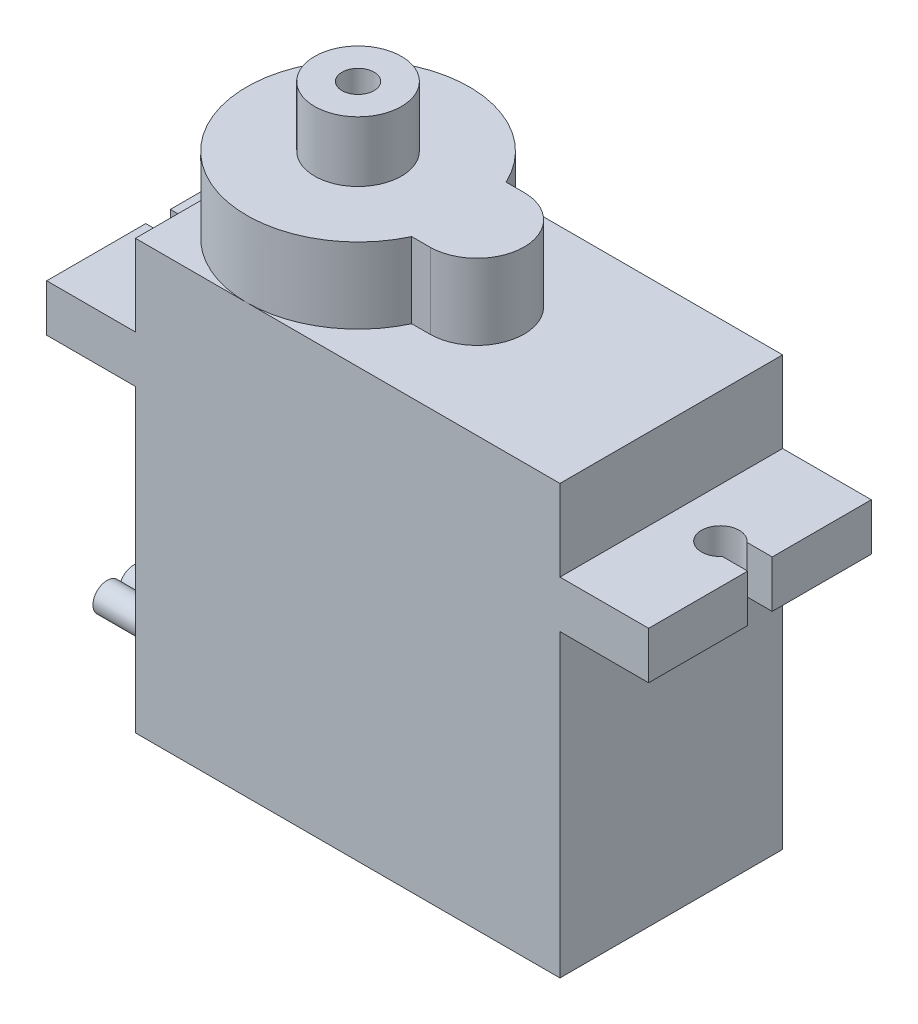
ISO-10303-21;
HEADER;
FILE_DESCRIPTION(('STEP AP214'),'2;1');
FILE_NAME('part.step','',(''),(''),'','','');
FILE_SCHEMA(('AUTOMOTIVE_DESIGN { 1 0 10303 214 1 1 1 1 }'));
ENDSEC;
DATA;
#1=APPLICATION_CONTEXT('core data for automotive mechanical design processes');
#2=APPLICATION_PROTOCOL_DEFINITION('international standard','automotive_design',2000,#1);
#3=PRODUCT_CONTEXT('',#1,'mechanical');
#4=PRODUCT('Part','Part','',(#3));
#5=PRODUCT_RELATED_PRODUCT_CATEGORY('part','',(#4));
#6=PRODUCT_DEFINITION_FORMATION('','',#4);
#7=PRODUCT_DEFINITION_CONTEXT('part definition',#1,'design');
#8=PRODUCT_DEFINITION('design','',#6,#7);
#9=PRODUCT_DEFINITION_SHAPE('','',#8);
#10=(LENGTH_UNIT() NAMED_UNIT(*) SI_UNIT(.MILLI.,.METRE.));
#11=(NAMED_UNIT(*) PLANE_ANGLE_UNIT() SI_UNIT($,.RADIAN.));
#12=(NAMED_UNIT(*) SI_UNIT($,.STERADIAN.) SOLID_ANGLE_UNIT());
#13=UNCERTAINTY_MEASURE_WITH_UNIT(LENGTH_MEASURE(1.E-05),#10,'distance_accuracy_value','');
#14=(GEOMETRIC_REPRESENTATION_CONTEXT(3) GLOBAL_UNCERTAINTY_ASSIGNED_CONTEXT((#13)) GLOBAL_UNIT_ASSIGNED_CONTEXT((#10,
#11,#12)) REPRESENTATION_CONTEXT('',''));
#15=CARTESIAN_POINT('',(0.,0.,0.));
#16=DIRECTION('',(0.,0.,1.));
#17=DIRECTION('',(1.,0.,0.));
#18=AXIS2_PLACEMENT_3D('',#15,#16,#17);
#19=CARTESIAN_POINT('',(27.2,18.4,5.9));
#20=DIRECTION('',(-1.,0.,0.));
#21=DIRECTION('',(0.,0.,1.));
#22=AXIS2_PLACEMENT_3D('',#19,#20,#21);
#23=PLANE('',#22);
#24=DIRECTION('',(0.,0.,-1.));
#25=VECTOR('',#24,1.);
#26=CARTESIAN_POINT('',(27.2,18.4,5.9));
#27=LINE('',#26,#25);
#28=CARTESIAN_POINT('',(27.2,18.4,-0.65));
#29=VERTEX_POINT('',#28);
#30=CARTESIAN_POINT('',(27.2,18.4,-5.9));
#31=VERTEX_POINT('',#30);
#32=EDGE_CURVE('E432',#29,#31,#27,.T.);
#33=ORIENTED_EDGE('',*,*,#32,.F.);
#34=DIRECTION('',(0.,-1.,0.));
#35=VECTOR('',#34,1.);
#36=CARTESIAN_POINT('',(27.2,18.4,-0.65));
#37=LINE('',#36,#35);
#38=CARTESIAN_POINT('',(27.2,15.9,-0.65));
#39=VERTEX_POINT('',#38);
#40=EDGE_CURVE('E294',#29,#39,#37,.T.);
#41=ORIENTED_EDGE('',*,*,#40,.T.);
#42=DIRECTION('',(0.,0.,-1.));
#43=VECTOR('',#42,1.);
#44=CARTESIAN_POINT('',(27.2,15.9,5.9));
#45=LINE('',#44,#43);
#46=CARTESIAN_POINT('',(27.2,15.9,-5.9));
#47=VERTEX_POINT('',#46);
#48=EDGE_CURVE('E436',#39,#47,#45,.T.);
#49=ORIENTED_EDGE('',*,*,#48,.T.);
#50=DIRECTION('',(0.,1.,0.));
#51=VECTOR('',#50,1.);
#52=CARTESIAN_POINT('',(27.2,18.4,-5.9));
#53=LINE('',#52,#51);
#54=EDGE_CURVE('E384',#47,#31,#53,.T.);
#55=ORIENTED_EDGE('',*,*,#54,.T.);
#56=EDGE_LOOP('',(#33,#41,#49,#55));
#57=FACE_BOUND('',#56,.T.);
#58=ADVANCED_FACE('F41',(#57),#23,.F.);
#59=CARTESIAN_POINT('',(-4.7,15.9,5.9));
#60=DIRECTION('',(1.,0.,0.));
#61=DIRECTION('',(0.,0.,-1.));
#62=AXIS2_PLACEMENT_3D('',#59,#60,#61);
#63=PLANE('',#62);
#64=DIRECTION('',(0.,0.,-1.));
#65=VECTOR('',#64,1.);
#66=CARTESIAN_POINT('',(-4.7,15.9,5.9));
#67=LINE('',#66,#65);
#68=CARTESIAN_POINT('',(-4.7,15.9,-0.65));
#69=VERTEX_POINT('',#68);
#70=CARTESIAN_POINT('',(-4.7,15.9,-5.9));
#71=VERTEX_POINT('',#70);
#72=EDGE_CURVE('E411',#69,#71,#67,.T.);
#73=ORIENTED_EDGE('',*,*,#72,.F.);
#74=DIRECTION('',(0.,1.,0.));
#75=VECTOR('',#74,1.);
#76=CARTESIAN_POINT('',(-4.7,15.9,-0.65));
#77=LINE('',#76,#75);
#78=CARTESIAN_POINT('',(-4.7,18.4,-0.65));
#79=VERTEX_POINT('',#78);
#80=EDGE_CURVE('E285',#69,#79,#77,.T.);
#81=ORIENTED_EDGE('',*,*,#80,.T.);
#82=DIRECTION('',(0.,0.,-1.));
#83=VECTOR('',#82,1.);
#84=CARTESIAN_POINT('',(-4.7,18.4,5.9));
#85=LINE('',#84,#83);
#86=CARTESIAN_POINT('',(-4.7,18.4,-5.9));
#87=VERTEX_POINT('',#86);
#88=EDGE_CURVE('E415',#79,#87,#85,.T.);
#89=ORIENTED_EDGE('',*,*,#88,.T.);
#90=DIRECTION('',(0.,-1.,0.));
#91=VECTOR('',#90,1.);
#92=CARTESIAN_POINT('',(-4.7,15.9,-5.9));
#93=LINE('',#92,#91);
#94=EDGE_CURVE('E400',#87,#71,#93,.T.);
#95=ORIENTED_EDGE('',*,*,#94,.T.);
#96=EDGE_LOOP('',(#73,#81,#89,#95));
#97=FACE_BOUND('',#96,.T.);
#98=ADVANCED_FACE('F462',(#97),#63,.F.);
#99=CARTESIAN_POINT('',(0.,22.7,5.9));
#100=DIRECTION('',(0.,-1.,0.));
#101=DIRECTION('',(1.,0.,0.));
#102=AXIS2_PLACEMENT_3D('',#99,#100,#101);
#103=PLANE('',#102);
#104=CARTESIAN_POINT('',(5.9,22.7,0.));
#105=DIRECTION('',(0.,1.,0.));
#106=DIRECTION('',(-1.,0.,0.));
#107=AXIS2_PLACEMENT_3D('',#104,#105,#106);
#108=CIRCLE('',#107,5.9);
#109=CARTESIAN_POINT('',(0.,22.7,0.));
#110=VERTEX_POINT('',#109);
#111=CARTESIAN_POINT('',(5.9,22.7,5.9));
#112=VERTEX_POINT('',#111);
#113=EDGE_CURVE('E332',#110,#112,#108,.T.);
#114=ORIENTED_EDGE('',*,*,#113,.F.);
#115=DIRECTION('',(0.,0.,-1.));
#116=VECTOR('',#115,1.);
#117=CARTESIAN_POINT('',(0.,22.7,5.9));
#118=LINE('',#117,#116);
#119=CARTESIAN_POINT('',(0.,22.7,5.9));
#120=VERTEX_POINT('',#119);
#121=EDGE_CURVE('E423',#120,#110,#118,.T.);
#122=ORIENTED_EDGE('',*,*,#121,.F.);
#123=DIRECTION('',(-1.,0.,0.));
#124=VECTOR('',#123,1.);
#125=CARTESIAN_POINT('',(0.,22.7,5.9));
#126=LINE('',#125,#124);
#127=EDGE_CURVE('E362',#112,#120,#126,.T.);
#128=ORIENTED_EDGE('',*,*,#127,.F.);
#129=EDGE_LOOP('',(#114,#122,#128));
#130=FACE_BOUND('',#129,.T.);
#131=ADVANCED_FACE('F518',(#130),#103,.F.);
#132=CARTESIAN_POINT('',(11.244155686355,22.7,2.5));
#133=VERTEX_POINT('',#132);
#134=EDGE_CURVE('E812',#112,#133,#108,.T.);
#135=ORIENTED_EDGE('',*,*,#134,.F.);
#136=CARTESIAN_POINT('',(22.5,22.7,5.9));
#137=VERTEX_POINT('',#136);
#138=EDGE_CURVE('E363',#137,#112,#126,.T.);
#139=ORIENTED_EDGE('',*,*,#138,.F.);
#140=DIRECTION('',(0.,0.,-1.));
#141=VECTOR('',#140,1.);
#142=CARTESIAN_POINT('',(22.5,22.7,5.9));
#143=LINE('',#142,#141);
#144=CARTESIAN_POINT('',(22.5,22.7,-5.9));
#145=VERTEX_POINT('',#144);
#146=EDGE_CURVE('E426',#137,#145,#143,.T.);
#147=ORIENTED_EDGE('',*,*,#146,.T.);
#148=DIRECTION('',(-1.,0.,0.));
#149=VECTOR('',#148,1.);
#150=CARTESIAN_POINT('',(0.,22.7,-5.9));
#151=LINE('',#150,#149);
#152=CARTESIAN_POINT('',(5.9,22.7,-5.9));
#153=VERTEX_POINT('',#152);
#154=EDGE_CURVE('E392',#145,#153,#151,.T.);
#155=ORIENTED_EDGE('',*,*,#154,.T.);
#156=CARTESIAN_POINT('',(11.244155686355,22.7,-2.5));
#157=VERTEX_POINT('',#156);
#158=EDGE_CURVE('E329',#157,#153,#108,.T.);
#159=ORIENTED_EDGE('',*,*,#158,.F.);
#160=DIRECTION('',(-1.,0.,0.));
#161=VECTOR('',#160,1.);
#162=CARTESIAN_POINT('',(11.244155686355,22.7,-2.5));
#163=LINE('',#162,#161);
#164=CARTESIAN_POINT('',(12.1689615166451,22.7,-2.5));
#165=VERTEX_POINT('',#164);
#166=EDGE_CURVE('E326',#165,#157,#163,.T.);
#167=ORIENTED_EDGE('',*,*,#166,.F.);
#168=CARTESIAN_POINT('',(12.2,22.7,0.));
#169=DIRECTION('',(0.,1.,0.));
#170=DIRECTION('',(-1.,0.,0.));
#171=AXIS2_PLACEMENT_3D('',#168,#169,#170);
#172=CIRCLE('',#171,2.50019267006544);
#173=CARTESIAN_POINT('',(12.2310384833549,22.7,2.5));
#174=VERTEX_POINT('',#173);
#175=EDGE_CURVE('E310',#174,#165,#172,.T.);
#176=ORIENTED_EDGE('',*,*,#175,.F.);
#177=DIRECTION('',(1.,0.,0.));
#178=VECTOR('',#177,1.);
#179=CARTESIAN_POINT('',(11.244155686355,22.7,2.5));
#180=LINE('',#179,#178);
#181=EDGE_CURVE('E317',#133,#174,#180,.T.);
#182=ORIENTED_EDGE('',*,*,#181,.F.);
#183=EDGE_LOOP('',(#135,#139,#147,#155,#159,#167,#176,#182));
#184=FACE_BOUND('',#183,.T.);
#185=ADVANCED_FACE('F668',(#184),#103,.F.);
#186=EDGE_CURVE('E333',#153,#110,#108,.T.);
#187=ORIENTED_EDGE('',*,*,#186,.F.);
#188=CARTESIAN_POINT('',(0.,22.7,-5.9));
#189=VERTEX_POINT('',#188);
#190=EDGE_CURVE('E391',#153,#189,#151,.T.);
#191=ORIENTED_EDGE('',*,*,#190,.T.);
#192=EDGE_CURVE('E422',#110,#189,#118,.T.);
#193=ORIENTED_EDGE('',*,*,#192,.F.);
#194=EDGE_LOOP('',(#187,#191,#193));
#195=FACE_BOUND('',#194,.T.);
#196=ADVANCED_FACE('F664',(#195),#103,.F.);
#197=CARTESIAN_POINT('',(22.5,0.,5.9));
#198=DIRECTION('',(0.,1.,0.));
#199=DIRECTION('',(-1.,0.,0.));
#200=AXIS2_PLACEMENT_3D('',#197,#198,#199);
#201=PLANE('',#200);
#202=DIRECTION('',(1.,0.,0.));
#203=VECTOR('',#202,1.);
#204=CARTESIAN_POINT('',(22.5,0.,-5.9));
#205=LINE('',#204,#203);
#206=CARTESIAN_POINT('',(0.,0.,-5.9));
#207=VERTEX_POINT('',#206);
#208=CARTESIAN_POINT('',(22.5,0.,-5.9));
#209=VERTEX_POINT('',#208);
#210=EDGE_CURVE('E347',#207,#209,#205,.T.);
#211=ORIENTED_EDGE('',*,*,#210,.T.);
#212=DIRECTION('',(0.,0.,-1.));
#213=VECTOR('',#212,1.);
#214=CARTESIAN_POINT('',(22.5,0.,5.9));
#215=LINE('',#214,#213);
#216=CARTESIAN_POINT('',(22.5,0.,5.9));
#217=VERTEX_POINT('',#216);
#218=EDGE_CURVE('E443',#217,#209,#215,.T.);
#219=ORIENTED_EDGE('',*,*,#218,.F.);
#220=DIRECTION('',(1.,0.,0.));
#221=VECTOR('',#220,1.);
#222=CARTESIAN_POINT('',(22.5,0.,5.9));
#223=LINE('',#222,#221);
#224=CARTESIAN_POINT('',(0.,0.,5.9));
#225=VERTEX_POINT('',#224);
#226=EDGE_CURVE('E348',#225,#217,#223,.T.);
#227=ORIENTED_EDGE('',*,*,#226,.F.);
#228=DIRECTION('',(0.,0.,-1.));
#229=VECTOR('',#228,1.);
#230=CARTESIAN_POINT('',(0.,0.,5.9));
#231=LINE('',#230,#229);
#232=EDGE_CURVE('E376',#225,#207,#231,.T.);
#233=ORIENTED_EDGE('',*,*,#232,.T.);
#234=EDGE_LOOP('',(#211,#219,#227,#233));
#235=FACE_BOUND('',#234,.T.);
#236=ADVANCED_FACE('F43',(#235),#201,.F.);
#237=CARTESIAN_POINT('',(22.5,15.9,5.9));
#238=DIRECTION('',(-1.,0.,0.));
#239=DIRECTION('',(0.,-1.,0.));
#240=AXIS2_PLACEMENT_3D('',#237,#238,#239);
#241=PLANE('',#240);
#242=DIRECTION('',(0.,1.,0.));
#243=VECTOR('',#242,1.);
#244=CARTESIAN_POINT('',(22.5,15.9,-5.9));
#245=LINE('',#244,#243);
#246=CARTESIAN_POINT('',(22.5,15.9,-5.9));
#247=VERTEX_POINT('',#246);
#248=EDGE_CURVE('E379',#209,#247,#245,.T.);
#249=ORIENTED_EDGE('',*,*,#248,.T.);
#250=DIRECTION('',(0.,0.,-1.));
#251=VECTOR('',#250,1.);
#252=CARTESIAN_POINT('',(22.5,15.9,5.9));
#253=LINE('',#252,#251);
#254=CARTESIAN_POINT('',(22.5,15.9,5.9));
#255=VERTEX_POINT('',#254);
#256=EDGE_CURVE('E440',#255,#247,#253,.T.);
#257=ORIENTED_EDGE('',*,*,#256,.F.);
#258=DIRECTION('',(0.,1.,0.));
#259=VECTOR('',#258,1.);
#260=CARTESIAN_POINT('',(22.5,15.9,5.9));
#261=LINE('',#260,#259);
#262=EDGE_CURVE('E351',#217,#255,#261,.T.);
#263=ORIENTED_EDGE('',*,*,#262,.F.);
#264=ORIENTED_EDGE('',*,*,#218,.T.);
#265=EDGE_LOOP('',(#249,#257,#263,#264));
#266=FACE_BOUND('',#265,.T.);
#267=ADVANCED_FACE('F533',(#266),#241,.F.);
#268=CARTESIAN_POINT('',(27.2,15.9,5.9));
#269=DIRECTION('',(0.,1.,0.));
#270=DIRECTION('',(0.,0.,1.));
#271=AXIS2_PLACEMENT_3D('',#268,#269,#270);
#272=PLANE('',#271);
#273=ORIENTED_EDGE('',*,*,#48,.F.);
#274=DIRECTION('',(-1.,0.,0.));
#275=VECTOR('',#274,1.);
#276=CARTESIAN_POINT('',(27.2,15.9,-0.65));
#277=LINE('',#276,#275);
#278=CARTESIAN_POINT('',(25.8599342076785,15.9,-0.65));
#279=VERTEX_POINT('',#278);
#280=EDGE_CURVE('E297',#39,#279,#277,.T.);
#281=ORIENTED_EDGE('',*,*,#280,.T.);
#282=CARTESIAN_POINT('',(25.1,15.9,0.));
#283=DIRECTION('',(0.,1.,0.));
#284=DIRECTION('',(0.,0.,1.));
#285=AXIS2_PLACEMENT_3D('',#282,#283,#284);
#286=CIRCLE('',#285,1.);
#287=CARTESIAN_POINT('',(25.8599342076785,15.9,0.649999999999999));
#288=VERTEX_POINT('',#287);
#289=EDGE_CURVE('E300',#279,#288,#286,.T.);
#290=ORIENTED_EDGE('',*,*,#289,.T.);
#291=DIRECTION('',(1.,0.,0.));
#292=VECTOR('',#291,1.);
#293=CARTESIAN_POINT('',(27.2,15.9,0.65));
#294=LINE('',#293,#292);
#295=CARTESIAN_POINT('',(27.2,15.9,0.65));
#296=VERTEX_POINT('',#295);
#297=EDGE_CURVE('E291',#288,#296,#294,.T.);
#298=ORIENTED_EDGE('',*,*,#297,.T.);
#299=CARTESIAN_POINT('',(27.2,15.9,5.9));
#300=VERTEX_POINT('',#299);
#301=EDGE_CURVE('E437',#300,#296,#45,.T.);
#302=ORIENTED_EDGE('',*,*,#301,.F.);
#303=DIRECTION('',(1.,0.,0.));
#304=VECTOR('',#303,1.);
#305=CARTESIAN_POINT('',(27.2,15.9,5.9));
#306=LINE('',#305,#304);
#307=EDGE_CURVE('E354',#255,#300,#306,.T.);
#308=ORIENTED_EDGE('',*,*,#307,.F.);
#309=ORIENTED_EDGE('',*,*,#256,.T.);
#310=DIRECTION('',(1.,0.,0.));
#311=VECTOR('',#310,1.);
#312=CARTESIAN_POINT('',(27.2,15.9,-5.9));
#313=LINE('',#312,#311);
#314=EDGE_CURVE('E381',#247,#47,#313,.T.);
#315=ORIENTED_EDGE('',*,*,#314,.T.);
#316=EDGE_LOOP('',(#273,#281,#290,#298,#302,#308,#309,#315));
#317=FACE_BOUND('',#316,.T.);
#318=ADVANCED_FACE('F525',(#317),#272,.F.);
#319=ORIENTED_EDGE('',*,*,#301,.T.);
#320=DIRECTION('',(0.,1.,0.));
#321=VECTOR('',#320,1.);
#322=CARTESIAN_POINT('',(27.2,18.4,0.65));
#323=LINE('',#322,#321);
#324=CARTESIAN_POINT('',(27.2,18.4,0.649999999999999));
#325=VERTEX_POINT('',#324);
#326=EDGE_CURVE('E288',#296,#325,#323,.T.);
#327=ORIENTED_EDGE('',*,*,#326,.T.);
#328=CARTESIAN_POINT('',(27.2,18.4,5.9));
#329=VERTEX_POINT('',#328);
#330=EDGE_CURVE('E433',#329,#325,#27,.T.);
#331=ORIENTED_EDGE('',*,*,#330,.F.);
#332=DIRECTION('',(0.,1.,0.));
#333=VECTOR('',#332,1.);
#334=CARTESIAN_POINT('',(27.2,18.4,5.9));
#335=LINE('',#334,#333);
#336=EDGE_CURVE('E356',#300,#329,#335,.T.);
#337=ORIENTED_EDGE('',*,*,#336,.F.);
#338=EDGE_LOOP('',(#319,#327,#331,#337));
#339=FACE_BOUND('',#338,.T.);
#340=ADVANCED_FACE('F514',(#339),#23,.F.);
#341=CARTESIAN_POINT('',(22.5,18.4,5.9));
#342=DIRECTION('',(0.,-1.,0.));
#343=DIRECTION('',(0.,0.,-1.));
#344=AXIS2_PLACEMENT_3D('',#341,#342,#343);
#345=PLANE('',#344);
#346=CARTESIAN_POINT('',(25.1,18.4,0.));
#347=DIRECTION('',(0.,1.,0.));
#348=DIRECTION('',(0.,0.,1.));
#349=AXIS2_PLACEMENT_3D('',#346,#347,#348);
#350=CIRCLE('',#349,1.);
#351=CARTESIAN_POINT('',(25.8599342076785,18.4,-0.65));
#352=VERTEX_POINT('',#351);
#353=CARTESIAN_POINT('',(25.8599342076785,18.4,0.65));
#354=VERTEX_POINT('',#353);
#355=EDGE_CURVE('E265',#352,#354,#350,.T.);
#356=ORIENTED_EDGE('',*,*,#355,.F.);
#357=DIRECTION('',(1.,0.,0.));
#358=VECTOR('',#357,1.);
#359=CARTESIAN_POINT('',(22.5,18.4,-0.65));
#360=LINE('',#359,#358);
#361=EDGE_CURVE('E11',#352,#29,#360,.T.);
#362=ORIENTED_EDGE('',*,*,#361,.T.);
#363=ORIENTED_EDGE('',*,*,#32,.T.);
#364=DIRECTION('',(-1.,0.,0.));
#365=VECTOR('',#364,1.);
#366=CARTESIAN_POINT('',(22.5,18.4,-5.9));
#367=LINE('',#366,#365);
#368=CARTESIAN_POINT('',(22.5,18.4,-5.9));
#369=VERTEX_POINT('',#368);
#370=EDGE_CURVE('E387',#31,#369,#367,.T.);
#371=ORIENTED_EDGE('',*,*,#370,.T.);
#372=DIRECTION('',(0.,0.,-1.));
#373=VECTOR('',#372,1.);
#374=CARTESIAN_POINT('',(22.5,18.4,5.9));
#375=LINE('',#374,#373);
#376=CARTESIAN_POINT('',(22.5,18.4,5.9));
#377=VERTEX_POINT('',#376);
#378=EDGE_CURVE('E429',#377,#369,#375,.T.);
#379=ORIENTED_EDGE('',*,*,#378,.F.);
#380=DIRECTION('',(-1.,0.,0.));
#381=VECTOR('',#380,1.);
#382=CARTESIAN_POINT('',(22.5,18.4,5.9));
#383=LINE('',#382,#381);
#384=EDGE_CURVE('E358',#329,#377,#383,.T.);
#385=ORIENTED_EDGE('',*,*,#384,.F.);
#386=ORIENTED_EDGE('',*,*,#330,.T.);
#387=DIRECTION('',(1.,0.,0.));
#388=VECTOR('',#387,1.);
#389=CARTESIAN_POINT('',(25.8599342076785,18.4,0.649999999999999));
#390=LINE('',#389,#388);
#391=EDGE_CURVE('E267',#354,#325,#390,.T.);
#392=ORIENTED_EDGE('',*,*,#391,.F.);
#393=EDGE_LOOP('',(#356,#362,#363,#371,#379,#385,#386,#392));
#394=FACE_BOUND('',#393,.T.);
#395=ADVANCED_FACE('F524',(#394),#345,.F.);
#396=CARTESIAN_POINT('',(22.5,22.7,5.9));
#397=DIRECTION('',(-1.,0.,0.));
#398=DIRECTION('',(0.,0.,1.));
#399=AXIS2_PLACEMENT_3D('',#396,#397,#398);
#400=PLANE('',#399);
#401=DIRECTION('',(0.,1.,0.));
#402=VECTOR('',#401,1.);
#403=CARTESIAN_POINT('',(22.5,22.7,-5.9));
#404=LINE('',#403,#402);
#405=EDGE_CURVE('E389',#369,#145,#404,.T.);
#406=ORIENTED_EDGE('',*,*,#405,.T.);
#407=ORIENTED_EDGE('',*,*,#146,.F.);
#408=DIRECTION('',(0.,1.,0.));
#409=VECTOR('',#408,1.);
#410=CARTESIAN_POINT('',(22.5,22.7,5.9));
#411=LINE('',#410,#409);
#412=EDGE_CURVE('E360',#377,#137,#411,.T.);
#413=ORIENTED_EDGE('',*,*,#412,.F.);
#414=ORIENTED_EDGE('',*,*,#378,.T.);
#415=EDGE_LOOP('',(#406,#407,#413,#414));
#416=FACE_BOUND('',#415,.T.);
#417=ADVANCED_FACE('F531',(#416),#400,.F.);
#418=CARTESIAN_POINT('',(0.,18.4,5.9));
#419=DIRECTION('',(1.,0.,0.));
#420=DIRECTION('',(0.,0.,-1.));
#421=AXIS2_PLACEMENT_3D('',#418,#419,#420);
#422=PLANE('',#421);
#423=DIRECTION('',(0.,-1.,0.));
#424=VECTOR('',#423,1.);
#425=CARTESIAN_POINT('',(0.,18.4,-5.9));
#426=LINE('',#425,#424);
#427=CARTESIAN_POINT('',(0.,18.4,-5.9));
#428=VERTEX_POINT('',#427);
#429=EDGE_CURVE('E395',#189,#428,#426,.T.);
#430=ORIENTED_EDGE('',*,*,#429,.T.);
#431=DIRECTION('',(0.,0.,-1.));
#432=VECTOR('',#431,1.);
#433=CARTESIAN_POINT('',(0.,18.4,5.9));
#434=LINE('',#433,#432);
#435=CARTESIAN_POINT('',(0.,18.4,5.9));
#436=VERTEX_POINT('',#435);
#437=EDGE_CURVE('E419',#436,#428,#434,.T.);
#438=ORIENTED_EDGE('',*,*,#437,.F.);
#439=DIRECTION('',(0.,-1.,0.));
#440=VECTOR('',#439,1.);
#441=CARTESIAN_POINT('',(0.,18.4,5.9));
#442=LINE('',#441,#440);
#443=EDGE_CURVE('E366',#120,#436,#442,.T.);
#444=ORIENTED_EDGE('',*,*,#443,.F.);
#445=ORIENTED_EDGE('',*,*,#121,.T.);
#446=ORIENTED_EDGE('',*,*,#192,.T.);
#447=EDGE_LOOP('',(#430,#438,#444,#445,#446));
#448=FACE_BOUND('',#447,.T.);
#449=ADVANCED_FACE('F795',(#448),#422,.F.);
#450=CARTESIAN_POINT('',(-4.7,18.4,5.9));
#451=DIRECTION('',(0.,-1.,0.));
#452=DIRECTION('',(0.,0.,-1.));
#453=AXIS2_PLACEMENT_3D('',#450,#451,#452);
#454=PLANE('',#453);
#455=ORIENTED_EDGE('',*,*,#88,.F.);
#456=DIRECTION('',(-1.,0.,0.));
#457=VECTOR('',#456,1.);
#458=CARTESIAN_POINT('',(-6.63542789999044,18.4,-0.65));
#459=LINE('',#458,#457);
#460=CARTESIAN_POINT('',(-3.35993420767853,18.4,-0.65));
#461=VERTEX_POINT('',#460);
#462=EDGE_CURVE('E278',#461,#79,#459,.T.);
#463=ORIENTED_EDGE('',*,*,#462,.F.);
#464=CARTESIAN_POINT('',(-2.6,18.4,0.));
#465=DIRECTION('',(0.,1.,0.));
#466=DIRECTION('',(0.,0.,1.));
#467=AXIS2_PLACEMENT_3D('',#464,#465,#466);
#468=CIRCLE('',#467,1.);
#469=CARTESIAN_POINT('',(-3.35993420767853,18.4,0.65));
#470=VERTEX_POINT('',#469);
#471=EDGE_CURVE('E259',#470,#461,#468,.T.);
#472=ORIENTED_EDGE('',*,*,#471,.F.);
#473=DIRECTION('',(1.,0.,0.));
#474=VECTOR('',#473,1.);
#475=CARTESIAN_POINT('',(-6.63542789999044,18.4,0.65));
#476=LINE('',#475,#474);
#477=CARTESIAN_POINT('',(-4.7,18.4,0.65));
#478=VERTEX_POINT('',#477);
#479=EDGE_CURVE('E256',#478,#470,#476,.T.);
#480=ORIENTED_EDGE('',*,*,#479,.F.);
#481=CARTESIAN_POINT('',(-4.7,18.4,5.9));
#482=VERTEX_POINT('',#481);
#483=EDGE_CURVE('E416',#482,#478,#85,.T.);
#484=ORIENTED_EDGE('',*,*,#483,.F.);
#485=DIRECTION('',(-1.,0.,0.));
#486=VECTOR('',#485,1.);
#487=CARTESIAN_POINT('',(-4.7,18.4,5.9));
#488=LINE('',#487,#486);
#489=EDGE_CURVE('E368',#436,#482,#488,.T.);
#490=ORIENTED_EDGE('',*,*,#489,.F.);
#491=ORIENTED_EDGE('',*,*,#437,.T.);
#492=DIRECTION('',(-1.,0.,0.));
#493=VECTOR('',#492,1.);
#494=CARTESIAN_POINT('',(-4.7,18.4,-5.9));
#495=LINE('',#494,#493);
#496=EDGE_CURVE('E397',#428,#87,#495,.T.);
#497=ORIENTED_EDGE('',*,*,#496,.T.);
#498=EDGE_LOOP('',(#455,#463,#472,#480,#484,#490,#491,#497));
#499=FACE_BOUND('',#498,.T.);
#500=ADVANCED_FACE('F491',(#499),#454,.F.);
#501=ORIENTED_EDGE('',*,*,#483,.T.);
#502=DIRECTION('',(0.,-1.,0.));
#503=VECTOR('',#502,1.);
#504=CARTESIAN_POINT('',(-4.7,15.9,0.65));
#505=LINE('',#504,#503);
#506=CARTESIAN_POINT('',(-4.7,15.9,0.65));
#507=VERTEX_POINT('',#506);
#508=EDGE_CURVE('E273',#478,#507,#505,.T.);
#509=ORIENTED_EDGE('',*,*,#508,.T.);
#510=CARTESIAN_POINT('',(-4.7,15.9,5.9));
#511=VERTEX_POINT('',#510);
#512=EDGE_CURVE('E412',#511,#507,#67,.T.);
#513=ORIENTED_EDGE('',*,*,#512,.F.);
#514=DIRECTION('',(0.,-1.,0.));
#515=VECTOR('',#514,1.);
#516=CARTESIAN_POINT('',(-4.7,15.9,5.9));
#517=LINE('',#516,#515);
#518=EDGE_CURVE('E370',#482,#511,#517,.T.);
#519=ORIENTED_EDGE('',*,*,#518,.F.);
#520=EDGE_LOOP('',(#501,#509,#513,#519));
#521=FACE_BOUND('',#520,.T.);
#522=ADVANCED_FACE('F484',(#521),#63,.F.);
#523=CARTESIAN_POINT('',(0.,15.9,5.9));
#524=DIRECTION('',(0.,1.,0.));
#525=DIRECTION('',(0.,0.,1.));
#526=AXIS2_PLACEMENT_3D('',#523,#524,#525);
#527=PLANE('',#526);
#528=CARTESIAN_POINT('',(-2.6,15.9,0.));
#529=DIRECTION('',(0.,1.,0.));
#530=DIRECTION('',(0.,0.,1.));
#531=AXIS2_PLACEMENT_3D('',#528,#529,#530);
#532=CIRCLE('',#531,1.);
#533=CARTESIAN_POINT('',(-3.35993420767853,15.9,0.65));
#534=VERTEX_POINT('',#533);
#535=CARTESIAN_POINT('',(-3.35993420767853,15.9,-0.65));
#536=VERTEX_POINT('',#535);
#537=EDGE_CURVE('E452',#534,#536,#532,.T.);
#538=ORIENTED_EDGE('',*,*,#537,.T.);
#539=DIRECTION('',(-1.,0.,0.));
#540=VECTOR('',#539,1.);
#541=CARTESIAN_POINT('',(0.,15.9,-0.65));
#542=LINE('',#541,#540);
#543=EDGE_CURVE('E49',#536,#69,#542,.T.);
#544=ORIENTED_EDGE('',*,*,#543,.T.);
#545=ORIENTED_EDGE('',*,*,#72,.T.);
#546=DIRECTION('',(1.,0.,0.));
#547=VECTOR('',#546,1.);
#548=CARTESIAN_POINT('',(0.,15.9,-5.9));
#549=LINE('',#548,#547);
#550=CARTESIAN_POINT('',(0.,15.9,-5.9));
#551=VERTEX_POINT('',#550);
#552=EDGE_CURVE('E403',#71,#551,#549,.T.);
#553=ORIENTED_EDGE('',*,*,#552,.T.);
#554=DIRECTION('',(0.,0.,-1.));
#555=VECTOR('',#554,1.);
#556=CARTESIAN_POINT('',(0.,15.9,5.9));
#557=LINE('',#556,#555);
#558=CARTESIAN_POINT('',(0.,15.9,5.9));
#559=VERTEX_POINT('',#558);
#560=EDGE_CURVE('E408',#559,#551,#557,.T.);
#561=ORIENTED_EDGE('',*,*,#560,.F.);
#562=DIRECTION('',(1.,0.,0.));
#563=VECTOR('',#562,1.);
#564=CARTESIAN_POINT('',(0.,15.9,5.9));
#565=LINE('',#564,#563);
#566=EDGE_CURVE('E372',#511,#559,#565,.T.);
#567=ORIENTED_EDGE('',*,*,#566,.F.);
#568=ORIENTED_EDGE('',*,*,#512,.T.);
#569=DIRECTION('',(1.,0.,0.));
#570=VECTOR('',#569,1.);
#571=CARTESIAN_POINT('',(0.,15.9,0.65));
#572=LINE('',#571,#570);
#573=EDGE_CURVE('E449',#507,#534,#572,.T.);
#574=ORIENTED_EDGE('',*,*,#573,.T.);
#575=EDGE_LOOP('',(#538,#544,#545,#553,#561,#567,#568,#574));
#576=FACE_BOUND('',#575,.T.);
#577=ADVANCED_FACE('F457',(#576),#527,.F.);
#578=CARTESIAN_POINT('',(0.,0.,5.9));
#579=DIRECTION('',(1.,0.,0.));
#580=DIRECTION('',(0.,0.,-1.));
#581=AXIS2_PLACEMENT_3D('',#578,#579,#580);
#582=PLANE('',#581);
#583=CARTESIAN_POINT('',(0.,1.,1.4));
#584=DIRECTION('',(-1.,0.,0.));
#585=DIRECTION('',(0.,0.,1.));
#586=AXIS2_PLACEMENT_3D('',#583,#584,#585);
#587=CIRCLE('',#586,0.75);
#588=CARTESIAN_POINT('',(0.,0.730741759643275,0.7));
#589=VERTEX_POINT('',#588);
#590=CARTESIAN_POINT('',(0.,1.26925824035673,0.7));
#591=VERTEX_POINT('',#590);
#592=EDGE_CURVE('E255',#589,#591,#587,.T.);
#593=ORIENTED_EDGE('',*,*,#592,.F.);
#594=CARTESIAN_POINT('',(0.,1.,0.));
#595=DIRECTION('',(-1.,0.,0.));
#596=DIRECTION('',(0.,0.,1.));
#597=AXIS2_PLACEMENT_3D('',#594,#595,#596);
#598=CIRCLE('',#597,0.75);
#599=CARTESIAN_POINT('',(0.,0.730741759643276,-0.7));
#600=VERTEX_POINT('',#599);
#601=EDGE_CURVE('E252',#600,#589,#598,.T.);
#602=ORIENTED_EDGE('',*,*,#601,.F.);
#603=CARTESIAN_POINT('',(0.,1.,-1.4));
#604=DIRECTION('',(-1.,0.,0.));
#605=DIRECTION('',(0.,0.,1.));
#606=AXIS2_PLACEMENT_3D('',#603,#604,#605);
#607=CIRCLE('',#606,0.75);
#608=CARTESIAN_POINT('',(0.,1.26925824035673,-0.7));
#609=VERTEX_POINT('',#608);
#610=EDGE_CURVE('E61',#609,#600,#607,.T.);
#611=ORIENTED_EDGE('',*,*,#610,.F.);
#612=CARTESIAN_POINT('',(0.,1.,0.));
#613=DIRECTION('',(-1.,0.,0.));
#614=DIRECTION('',(0.,0.,1.));
#615=AXIS2_PLACEMENT_3D('',#612,#613,#614);
#616=CIRCLE('',#615,0.75);
#617=EDGE_CURVE('E56',#591,#609,#616,.T.);
#618=ORIENTED_EDGE('',*,*,#617,.F.);
#619=EDGE_LOOP('',(#593,#602,#611,#618));
#620=FACE_BOUND('',#619,.T.);
#621=DIRECTION('',(0.,-1.,0.));
#622=VECTOR('',#621,1.);
#623=CARTESIAN_POINT('',(0.,0.,-5.9));
#624=LINE('',#623,#622);
#625=EDGE_CURVE('E352',#551,#207,#624,.T.);
#626=ORIENTED_EDGE('',*,*,#625,.T.);
#627=ORIENTED_EDGE('',*,*,#232,.F.);
#628=DIRECTION('',(0.,-1.,0.));
#629=VECTOR('',#628,1.);
#630=CARTESIAN_POINT('',(0.,0.,5.9));
#631=LINE('',#630,#629);
#632=EDGE_CURVE('E374',#559,#225,#631,.T.);
#633=ORIENTED_EDGE('',*,*,#632,.F.);
#634=ORIENTED_EDGE('',*,*,#560,.T.);
#635=EDGE_LOOP('',(#626,#627,#633,#634));
#636=FACE_BOUND('',#635,.T.);
#637=ADVANCED_FACE('F475',(#620,#636),#582,.F.);
#638=CARTESIAN_POINT('',(0.,0.,5.9));
#639=DIRECTION('',(0.,0.,-1.));
#640=DIRECTION('',(-1.,0.,0.));
#641=AXIS2_PLACEMENT_3D('',#638,#639,#640);
#642=PLANE('',#641);
#643=ORIENTED_EDGE('',*,*,#226,.T.);
#644=ORIENTED_EDGE('',*,*,#262,.T.);
#645=ORIENTED_EDGE('',*,*,#307,.T.);
#646=ORIENTED_EDGE('',*,*,#336,.T.);
#647=ORIENTED_EDGE('',*,*,#384,.T.);
#648=ORIENTED_EDGE('',*,*,#412,.T.);
#649=ORIENTED_EDGE('',*,*,#138,.T.);
#650=ORIENTED_EDGE('',*,*,#127,.T.);
#651=ORIENTED_EDGE('',*,*,#443,.T.);
#652=ORIENTED_EDGE('',*,*,#489,.T.);
#653=ORIENTED_EDGE('',*,*,#518,.T.);
#654=ORIENTED_EDGE('',*,*,#566,.T.);
#655=ORIENTED_EDGE('',*,*,#632,.T.);
#656=EDGE_LOOP('',(#643,#644,#645,#646,#647,#648,#649,#650,#651,#652,#653,#654,#655));
#657=FACE_BOUND('',#656,.T.);
#658=ADVANCED_FACE('F479',(#657),#642,.F.);
#659=CARTESIAN_POINT('',(0.,0.,-5.9));
#660=DIRECTION('',(0.,0.,-1.));
#661=DIRECTION('',(-1.,0.,0.));
#662=AXIS2_PLACEMENT_3D('',#659,#660,#661);
#663=PLANE('',#662);
#664=ORIENTED_EDGE('',*,*,#210,.F.);
#665=ORIENTED_EDGE('',*,*,#625,.F.);
#666=ORIENTED_EDGE('',*,*,#552,.F.);
#667=ORIENTED_EDGE('',*,*,#94,.F.);
#668=ORIENTED_EDGE('',*,*,#496,.F.);
#669=ORIENTED_EDGE('',*,*,#429,.F.);
#670=ORIENTED_EDGE('',*,*,#190,.F.);
#671=ORIENTED_EDGE('',*,*,#154,.F.);
#672=ORIENTED_EDGE('',*,*,#405,.F.);
#673=ORIENTED_EDGE('',*,*,#370,.F.);
#674=ORIENTED_EDGE('',*,*,#54,.F.);
#675=ORIENTED_EDGE('',*,*,#314,.F.);
#676=ORIENTED_EDGE('',*,*,#248,.F.);
#677=EDGE_LOOP('',(#664,#665,#666,#667,#668,#669,#670,#671,#672,#673,#674,#675,#676));
#678=FACE_BOUND('',#677,.T.);
#679=ADVANCED_FACE('F470',(#678),#663,.T.);
#680=CARTESIAN_POINT('',(12.2,26.7,0.));
#681=DIRECTION('',(0.,-1.,0.));
#682=DIRECTION('',(1.,0.,0.));
#683=AXIS2_PLACEMENT_3D('',#680,#681,#682);
#684=CYLINDRICAL_SURFACE('',#683,2.50019267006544);
#685=ORIENTED_EDGE('',*,*,#175,.T.);
#686=DIRECTION('',(0.,-1.,0.));
#687=VECTOR('',#686,1.);
#688=CARTESIAN_POINT('',(12.1689615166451,26.7,-2.5));
#689=LINE('',#688,#687);
#690=CARTESIAN_POINT('',(12.1689615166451,26.7,-2.5));
#691=VERTEX_POINT('',#690);
#692=EDGE_CURVE('E344',#691,#165,#689,.T.);
#693=ORIENTED_EDGE('',*,*,#692,.F.);
#694=CARTESIAN_POINT('',(12.2,26.7,0.));
#695=DIRECTION('',(0.,1.,0.));
#696=DIRECTION('',(-1.,0.,0.));
#697=AXIS2_PLACEMENT_3D('',#694,#695,#696);
#698=CIRCLE('',#697,2.50019267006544);
#699=CARTESIAN_POINT('',(12.2310384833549,26.7,2.5));
#700=VERTEX_POINT('',#699);
#701=EDGE_CURVE('E313',#700,#691,#698,.T.);
#702=ORIENTED_EDGE('',*,*,#701,.F.);
#703=DIRECTION('',(0.,-1.,0.));
#704=VECTOR('',#703,1.);
#705=CARTESIAN_POINT('',(12.2310384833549,26.7,2.5));
#706=LINE('',#705,#704);
#707=EDGE_CURVE('E323',#700,#174,#706,.T.);
#708=ORIENTED_EDGE('',*,*,#707,.T.);
#709=EDGE_LOOP('',(#685,#693,#702,#708));
#710=FACE_BOUND('',#709,.T.);
#711=ADVANCED_FACE('F657',(#710),#684,.T.);
#712=CARTESIAN_POINT('',(11.244155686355,26.7,-2.5));
#713=DIRECTION('',(0.,0.,1.));
#714=DIRECTION('',(1.,0.,0.));
#715=AXIS2_PLACEMENT_3D('',#712,#713,#714);
#716=PLANE('',#715);
#717=ORIENTED_EDGE('',*,*,#166,.T.);
#718=DIRECTION('',(0.,-1.,0.));
#719=VECTOR('',#718,1.);
#720=CARTESIAN_POINT('',(11.244155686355,26.7,-2.5));
#721=LINE('',#720,#719);
#722=CARTESIAN_POINT('',(11.244155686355,26.7,-2.5));
#723=VERTEX_POINT('',#722);
#724=EDGE_CURVE('E341',#723,#157,#721,.T.);
#725=ORIENTED_EDGE('',*,*,#724,.F.);
#726=DIRECTION('',(-1.,0.,0.));
#727=VECTOR('',#726,1.);
#728=CARTESIAN_POINT('',(11.244155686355,26.7,-2.5));
#729=LINE('',#728,#727);
#730=EDGE_CURVE('E316',#691,#723,#729,.T.);
#731=ORIENTED_EDGE('',*,*,#730,.F.);
#732=ORIENTED_EDGE('',*,*,#692,.T.);
#733=EDGE_LOOP('',(#717,#725,#731,#732));
#734=FACE_BOUND('',#733,.T.);
#735=ADVANCED_FACE('F690',(#734),#716,.F.);
#736=CARTESIAN_POINT('',(5.9,26.7,0.));
#737=DIRECTION('',(0.,-1.,0.));
#738=DIRECTION('',(1.,0.,0.));
#739=AXIS2_PLACEMENT_3D('',#736,#737,#738);
#740=CYLINDRICAL_SURFACE('',#739,5.9);
#741=ORIENTED_EDGE('',*,*,#158,.T.);
#742=ORIENTED_EDGE('',*,*,#186,.T.);
#743=ORIENTED_EDGE('',*,*,#113,.T.);
#744=ORIENTED_EDGE('',*,*,#134,.T.);
#745=DIRECTION('',(0.,-1.,0.));
#746=VECTOR('',#745,1.);
#747=CARTESIAN_POINT('',(11.244155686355,26.7,2.5));
#748=LINE('',#747,#746);
#749=CARTESIAN_POINT('',(11.244155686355,26.7,2.5));
#750=VERTEX_POINT('',#749);
#751=EDGE_CURVE('E338',#750,#133,#748,.T.);
#752=ORIENTED_EDGE('',*,*,#751,.F.);
#753=CARTESIAN_POINT('',(5.9,26.7,0.));
#754=DIRECTION('',(0.,1.,0.));
#755=DIRECTION('',(-1.,0.,0.));
#756=AXIS2_PLACEMENT_3D('',#753,#754,#755);
#757=CIRCLE('',#756,5.9);
#758=EDGE_CURVE('E319',#723,#750,#757,.T.);
#759=ORIENTED_EDGE('',*,*,#758,.F.);
#760=ORIENTED_EDGE('',*,*,#724,.T.);
#761=EDGE_LOOP('',(#741,#742,#743,#744,#752,#759,#760));
#762=FACE_BOUND('',#761,.T.);
#763=ADVANCED_FACE('F697',(#762),#740,.T.);
#764=CARTESIAN_POINT('',(11.244155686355,26.7,2.5));
#765=DIRECTION('',(0.,0.,-1.));
#766=DIRECTION('',(-1.,0.,0.));
#767=AXIS2_PLACEMENT_3D('',#764,#765,#766);
#768=PLANE('',#767);
#769=ORIENTED_EDGE('',*,*,#181,.T.);
#770=ORIENTED_EDGE('',*,*,#707,.F.);
#771=DIRECTION('',(1.,0.,0.));
#772=VECTOR('',#771,1.);
#773=CARTESIAN_POINT('',(11.244155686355,26.7,2.5));
#774=LINE('',#773,#772);
#775=EDGE_CURVE('E321',#750,#700,#774,.T.);
#776=ORIENTED_EDGE('',*,*,#775,.F.);
#777=ORIENTED_EDGE('',*,*,#751,.T.);
#778=EDGE_LOOP('',(#769,#770,#776,#777));
#779=FACE_BOUND('',#778,.T.);
#780=ADVANCED_FACE('F705',(#779),#768,.F.);
#781=CARTESIAN_POINT('',(12.2,26.7,0.));
#782=DIRECTION('',(0.,1.,0.));
#783=DIRECTION('',(-1.,0.,0.));
#784=AXIS2_PLACEMENT_3D('',#781,#782,#783);
#785=PLANE('',#784);
#786=CARTESIAN_POINT('',(5.9,26.7,0.));
#787=DIRECTION('',(0.,1.,0.));
#788=DIRECTION('',(-1.,0.,0.));
#789=AXIS2_PLACEMENT_3D('',#786,#787,#788);
#790=CIRCLE('',#789,2.3);
#791=CARTESIAN_POINT('',(3.6,26.7,0.));
#792=VERTEX_POINT('',#791);
#793=EDGE_CURVE('E306',#792,#792,#790,.T.);
#794=ORIENTED_EDGE('',*,*,#793,.F.);
#795=EDGE_LOOP('',(#794));
#796=FACE_BOUND('',#795,.T.);
#797=ORIENTED_EDGE('',*,*,#701,.T.);
#798=ORIENTED_EDGE('',*,*,#730,.T.);
#799=ORIENTED_EDGE('',*,*,#758,.T.);
#800=ORIENTED_EDGE('',*,*,#775,.T.);
#801=EDGE_LOOP('',(#797,#798,#799,#800));
#802=FACE_BOUND('',#801,.T.);
#803=ADVANCED_FACE('F509',(#796,#802),#785,.T.);
#804=CARTESIAN_POINT('',(5.9,29.9,0.));
#805=DIRECTION('',(0.,1.,0.));
#806=DIRECTION('',(-1.,0.,0.));
#807=AXIS2_PLACEMENT_3D('',#804,#805,#806);
#808=PLANE('',#807);
#809=CARTESIAN_POINT('',(5.9,29.9,0.));
#810=DIRECTION('',(0.,1.,0.));
#811=DIRECTION('',(-1.,0.,0.));
#812=AXIS2_PLACEMENT_3D('',#809,#810,#811);
#813=CIRCLE('',#812,2.3);
#814=CARTESIAN_POINT('',(3.60000000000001,29.9,0.));
#815=VERTEX_POINT('',#814);
#816=EDGE_CURVE('E307',#815,#815,#813,.T.);
#817=ORIENTED_EDGE('',*,*,#816,.T.);
#818=EDGE_LOOP('',(#817));
#819=FACE_BOUND('',#818,.T.);
#820=CARTESIAN_POINT('',(5.9,29.9,0.));
#821=DIRECTION('',(0.,1.,0.));
#822=DIRECTION('',(-1.,0.,0.));
#823=AXIS2_PLACEMENT_3D('',#820,#821,#822);
#824=CIRCLE('',#823,0.85);
#825=CARTESIAN_POINT('',(5.05,29.9,0.));
#826=VERTEX_POINT('',#825);
#827=EDGE_CURVE('E303',#826,#826,#824,.T.);
#828=ORIENTED_EDGE('',*,*,#827,.F.);
#829=EDGE_LOOP('',(#828));
#830=FACE_BOUND('',#829,.T.);
#831=ADVANCED_FACE('F721',(#819,#830),#808,.T.);
#832=CARTESIAN_POINT('',(5.9,29.9,0.));
#833=DIRECTION('',(0.,-1.,0.));
#834=DIRECTION('',(1.,0.,0.));
#835=AXIS2_PLACEMENT_3D('',#832,#833,#834);
#836=CYLINDRICAL_SURFACE('',#835,2.3);
#837=ORIENTED_EDGE('',*,*,#816,.F.);
#838=EDGE_LOOP('',(#837));
#839=FACE_BOUND('',#838,.T.);
#840=ORIENTED_EDGE('',*,*,#793,.T.);
#841=EDGE_LOOP('',(#840));
#842=FACE_BOUND('',#841,.T.);
#843=ADVANCED_FACE('F736',(#839,#842),#836,.T.);
#844=CARTESIAN_POINT('',(5.9,29.9,0.));
#845=DIRECTION('',(0.,-1.,0.));
#846=DIRECTION('',(1.,0.,0.));
#847=AXIS2_PLACEMENT_3D('',#844,#845,#846);
#848=CYLINDRICAL_SURFACE('',#847,0.85);
#849=ORIENTED_EDGE('',*,*,#827,.T.);
#850=EDGE_LOOP('',(#849));
#851=FACE_BOUND('',#850,.T.);
#852=CARTESIAN_POINT('',(5.9,26.7,0.));
#853=DIRECTION('',(0.,1.,0.));
#854=DIRECTION('',(-1.,0.,0.));
#855=AXIS2_PLACEMENT_3D('',#852,#853,#854);
#856=CIRCLE('',#855,0.85);
#857=CARTESIAN_POINT('',(5.05,26.7,0.));
#858=VERTEX_POINT('',#857);
#859=EDGE_CURVE('E446',#858,#858,#856,.F.);
#860=ORIENTED_EDGE('',*,*,#859,.T.);
#861=EDGE_LOOP('',(#860));
#862=FACE_BOUND('',#861,.T.);
#863=ADVANCED_FACE('F506',(#851,#862),#848,.F.);
#864=ORIENTED_EDGE('',*,*,#859,.F.);
#865=EDGE_LOOP('',(#864));
#866=FACE_BOUND('',#865,.T.);
#867=ADVANCED_FACE('F498',(#866),#785,.T.);
#868=CARTESIAN_POINT('',(-6.63542789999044,15.2,-0.65));
#869=DIRECTION('',(0.,0.,-1.));
#870=DIRECTION('',(-1.,0.,0.));
#871=AXIS2_PLACEMENT_3D('',#868,#869,#870);
#872=PLANE('',#871);
#873=ORIENTED_EDGE('',*,*,#543,.F.);
#874=DIRECTION('',(0.,1.,0.));
#875=VECTOR('',#874,1.);
#876=CARTESIAN_POINT('',(-3.35993420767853,15.2,-0.65));
#877=LINE('',#876,#875);
#878=EDGE_CURVE('E268',#536,#461,#877,.T.);
#879=ORIENTED_EDGE('',*,*,#878,.T.);
#880=ORIENTED_EDGE('',*,*,#462,.T.);
#881=ORIENTED_EDGE('',*,*,#80,.F.);
#882=EDGE_LOOP('',(#873,#879,#880,#881));
#883=FACE_BOUND('',#882,.T.);
#884=ADVANCED_FACE('F496',(#883),#872,.F.);
#885=CARTESIAN_POINT('',(-2.6,15.2,0.));
#886=DIRECTION('',(0.,1.,0.));
#887=DIRECTION('',(0.,0.,1.));
#888=AXIS2_PLACEMENT_3D('',#885,#886,#887);
#889=CYLINDRICAL_SURFACE('',#888,1.);
#890=DIRECTION('',(0.,1.,0.));
#891=VECTOR('',#890,1.);
#892=CARTESIAN_POINT('',(-3.35993420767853,15.2,0.65));
#893=LINE('',#892,#891);
#894=EDGE_CURVE('E280',#534,#470,#893,.T.);
#895=ORIENTED_EDGE('',*,*,#894,.T.);
#896=ORIENTED_EDGE('',*,*,#471,.T.);
#897=ORIENTED_EDGE('',*,*,#878,.F.);
#898=ORIENTED_EDGE('',*,*,#537,.F.);
#899=EDGE_LOOP('',(#895,#896,#897,#898));
#900=FACE_BOUND('',#899,.T.);
#901=ADVANCED_FACE('F495',(#900),#889,.F.);
#902=CARTESIAN_POINT('',(-6.63542789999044,15.2,0.65));
#903=DIRECTION('',(0.,0.,1.));
#904=DIRECTION('',(1.,0.,0.));
#905=AXIS2_PLACEMENT_3D('',#902,#903,#904);
#906=PLANE('',#905);
#907=ORIENTED_EDGE('',*,*,#479,.T.);
#908=ORIENTED_EDGE('',*,*,#894,.F.);
#909=ORIENTED_EDGE('',*,*,#573,.F.);
#910=ORIENTED_EDGE('',*,*,#508,.F.);
#911=EDGE_LOOP('',(#907,#908,#909,#910));
#912=FACE_BOUND('',#911,.T.);
#913=ADVANCED_FACE('F488',(#912),#906,.F.);
#914=CARTESIAN_POINT('',(25.1,15.2,0.));
#915=DIRECTION('',(0.,1.,0.));
#916=DIRECTION('',(0.,0.,1.));
#917=AXIS2_PLACEMENT_3D('',#914,#915,#916);
#918=CYLINDRICAL_SURFACE('',#917,1.);
#919=DIRECTION('',(0.,1.,0.));
#920=VECTOR('',#919,1.);
#921=CARTESIAN_POINT('',(25.8599342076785,15.2,-0.65));
#922=LINE('',#921,#920);
#923=EDGE_CURVE('E271',#279,#352,#922,.T.);
#924=ORIENTED_EDGE('',*,*,#923,.T.);
#925=ORIENTED_EDGE('',*,*,#355,.T.);
#926=DIRECTION('',(0.,1.,0.));
#927=VECTOR('',#926,1.);
#928=CARTESIAN_POINT('',(25.8599342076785,15.2,0.649999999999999));
#929=LINE('',#928,#927);
#930=EDGE_CURVE('E270',#288,#354,#929,.T.);
#931=ORIENTED_EDGE('',*,*,#930,.F.);
#932=ORIENTED_EDGE('',*,*,#289,.F.);
#933=EDGE_LOOP('',(#924,#925,#931,#932));
#934=FACE_BOUND('',#933,.T.);
#935=ADVANCED_FACE('F545',(#934),#918,.F.);
#936=CARTESIAN_POINT('',(25.8599342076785,15.2,-0.65));
#937=DIRECTION('',(0.,0.,-1.));
#938=DIRECTION('',(-1.,0.,0.));
#939=AXIS2_PLACEMENT_3D('',#936,#937,#938);
#940=PLANE('',#939);
#941=ORIENTED_EDGE('',*,*,#40,.F.);
#942=ORIENTED_EDGE('',*,*,#361,.F.);
#943=ORIENTED_EDGE('',*,*,#923,.F.);
#944=ORIENTED_EDGE('',*,*,#280,.F.);
#945=EDGE_LOOP('',(#941,#942,#943,#944));
#946=FACE_BOUND('',#945,.T.);
#947=ADVANCED_FACE('F560',(#946),#940,.F.);
#948=CARTESIAN_POINT('',(25.8599342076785,15.2,0.649999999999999));
#949=DIRECTION('',(0.,0.,1.));
#950=DIRECTION('',(1.,0.,0.));
#951=AXIS2_PLACEMENT_3D('',#948,#949,#950);
#952=PLANE('',#951);
#953=ORIENTED_EDGE('',*,*,#930,.T.);
#954=ORIENTED_EDGE('',*,*,#391,.T.);
#955=ORIENTED_EDGE('',*,*,#326,.F.);
#956=ORIENTED_EDGE('',*,*,#297,.F.);
#957=EDGE_LOOP('',(#953,#954,#955,#956));
#958=FACE_BOUND('',#957,.T.);
#959=ADVANCED_FACE('F542',(#958),#952,.F.);
#960=CARTESIAN_POINT('',(-6.,1.,1.4));
#961=DIRECTION('',(1.,0.,0.));
#962=DIRECTION('',(0.,0.,-1.));
#963=AXIS2_PLACEMENT_3D('',#960,#961,#962);
#964=CYLINDRICAL_SURFACE('',#963,0.75);
#965=ORIENTED_EDGE('',*,*,#592,.T.);
#966=DIRECTION('',(1.,0.,0.));
#967=VECTOR('',#966,1.);
#968=CARTESIAN_POINT('',(-6.,1.26925824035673,0.7));
#969=LINE('',#968,#967);
#970=CARTESIAN_POINT('',(-6.,1.26925824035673,0.7));
#971=VERTEX_POINT('',#970);
#972=EDGE_CURVE('E236',#971,#591,#969,.T.);
#973=ORIENTED_EDGE('',*,*,#972,.F.);
#974=CARTESIAN_POINT('',(-6.,1.,1.4));
#975=DIRECTION('',(-1.,0.,0.));
#976=DIRECTION('',(0.,0.,1.));
#977=AXIS2_PLACEMENT_3D('',#974,#975,#976);
#978=CIRCLE('',#977,0.75);
#979=CARTESIAN_POINT('',(-6.,0.730741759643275,0.7));
#980=VERTEX_POINT('',#979);
#981=EDGE_CURVE('E243',#980,#971,#978,.T.);
#982=ORIENTED_EDGE('',*,*,#981,.F.);
#983=DIRECTION('',(1.,0.,0.));
#984=VECTOR('',#983,1.);
#985=CARTESIAN_POINT('',(-6.,0.730741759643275,0.7));
#986=LINE('',#985,#984);
#987=EDGE_CURVE('E908',#980,#589,#986,.T.);
#988=ORIENTED_EDGE('',*,*,#987,.T.);
#989=EDGE_LOOP('',(#965,#973,#982,#988));
#990=FACE_BOUND('',#989,.T.);
#991=ADVANCED_FACE('F254',(#990),#964,.T.);
#992=CARTESIAN_POINT('',(-6.,1.,0.));
#993=DIRECTION('',(1.,0.,0.));
#994=DIRECTION('',(0.,0.,-1.));
#995=AXIS2_PLACEMENT_3D('',#992,#993,#994);
#996=CYLINDRICAL_SURFACE('',#995,0.75);
#997=ORIENTED_EDGE('',*,*,#617,.T.);
#998=DIRECTION('',(1.,0.,0.));
#999=VECTOR('',#998,1.);
#1000=CARTESIAN_POINT('',(-6.,1.26925824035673,-0.7));
#1001=LINE('',#1000,#999);
#1002=CARTESIAN_POINT('',(-6.,1.26925824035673,-0.7));
#1003=VERTEX_POINT('',#1002);
#1004=EDGE_CURVE('E239',#1003,#609,#1001,.T.);
#1005=ORIENTED_EDGE('',*,*,#1004,.F.);
#1006=CARTESIAN_POINT('',(-6.,1.,0.));
#1007=DIRECTION('',(-1.,0.,0.));
#1008=DIRECTION('',(0.,0.,1.));
#1009=AXIS2_PLACEMENT_3D('',#1006,#1007,#1008);
#1010=CIRCLE('',#1009,0.75);
#1011=EDGE_CURVE('E232',#971,#1003,#1010,.T.);
#1012=ORIENTED_EDGE('',*,*,#1011,.F.);
#1013=ORIENTED_EDGE('',*,*,#972,.T.);
#1014=EDGE_LOOP('',(#997,#1005,#1012,#1013));
#1015=FACE_BOUND('',#1014,.T.);
#1016=ADVANCED_FACE('F234',(#1015),#996,.T.);
#1017=CARTESIAN_POINT('',(-6.,1.,-1.4));
#1018=DIRECTION('',(1.,0.,0.));
#1019=DIRECTION('',(0.,0.,-1.));
#1020=AXIS2_PLACEMENT_3D('',#1017,#1018,#1019);
#1021=CYLINDRICAL_SURFACE('',#1020,0.75);
#1022=ORIENTED_EDGE('',*,*,#610,.T.);
#1023=DIRECTION('',(1.,0.,0.));
#1024=VECTOR('',#1023,1.);
#1025=CARTESIAN_POINT('',(-6.,0.730741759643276,-0.7));
#1026=LINE('',#1025,#1024);
#1027=CARTESIAN_POINT('',(-6.,0.730741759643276,-0.7));
#1028=VERTEX_POINT('',#1027);
#1029=EDGE_CURVE('E261',#1028,#600,#1026,.T.);
#1030=ORIENTED_EDGE('',*,*,#1029,.F.);
#1031=CARTESIAN_POINT('',(-6.,1.,-1.4));
#1032=DIRECTION('',(-1.,0.,0.));
#1033=DIRECTION('',(0.,0.,1.));
#1034=AXIS2_PLACEMENT_3D('',#1031,#1032,#1033);
#1035=CIRCLE('',#1034,0.75);
#1036=EDGE_CURVE('E242',#1003,#1028,#1035,.T.);
#1037=ORIENTED_EDGE('',*,*,#1036,.F.);
#1038=ORIENTED_EDGE('',*,*,#1004,.T.);
#1039=EDGE_LOOP('',(#1022,#1030,#1037,#1038));
#1040=FACE_BOUND('',#1039,.T.);
#1041=ADVANCED_FACE('F573',(#1040),#1021,.T.);
#1042=CARTESIAN_POINT('',(-6.,1.,0.));
#1043=DIRECTION('',(1.,0.,0.));
#1044=DIRECTION('',(0.,0.,-1.));
#1045=AXIS2_PLACEMENT_3D('',#1042,#1043,#1044);
#1046=CYLINDRICAL_SURFACE('',#1045,0.75);
#1047=ORIENTED_EDGE('',*,*,#601,.T.);
#1048=ORIENTED_EDGE('',*,*,#987,.F.);
#1049=CARTESIAN_POINT('',(-6.,1.,0.));
#1050=DIRECTION('',(-1.,0.,0.));
#1051=DIRECTION('',(0.,0.,1.));
#1052=AXIS2_PLACEMENT_3D('',#1049,#1050,#1051);
#1053=CIRCLE('',#1052,0.75);
#1054=EDGE_CURVE('E248',#1028,#980,#1053,.T.);
#1055=ORIENTED_EDGE('',*,*,#1054,.F.);
#1056=ORIENTED_EDGE('',*,*,#1029,.T.);
#1057=EDGE_LOOP('',(#1047,#1048,#1055,#1056));
#1058=FACE_BOUND('',#1057,.T.);
#1059=ADVANCED_FACE('F576',(#1058),#1046,.T.);
#1060=CARTESIAN_POINT('',(-6.,1.,0.7));
#1061=DIRECTION('',(-1.,0.,0.));
#1062=DIRECTION('',(0.,0.,1.));
#1063=AXIS2_PLACEMENT_3D('',#1060,#1061,#1062);
#1064=PLANE('',#1063);
#1065=ORIENTED_EDGE('',*,*,#981,.T.);
#1066=ORIENTED_EDGE('',*,*,#1011,.T.);
#1067=ORIENTED_EDGE('',*,*,#1036,.T.);
#1068=ORIENTED_EDGE('',*,*,#1054,.T.);
#1069=EDGE_LOOP('',(#1065,#1066,#1067,#1068));
#1070=FACE_BOUND('',#1069,.T.);
#1071=ADVANCED_FACE('F246',(#1070),#1064,.T.);
#1072=CLOSED_SHELL('',(#58,#98,#131,#185,#196,#236,#267,#318,#340,#395,#417,#449,#500,#522,#577,
#637,#658,#679,#711,#735,#763,#780,#803,#831,#843,#863,#867,#884,#901,#913,#935,#947,#959,#991,
#1016,#1041,#1059,#1071));
#1073=MANIFOLD_SOLID_BREP('B2',#1072);
#1074=ADVANCED_BREP_SHAPE_REPRESENTATION('',(#18,#1073),#14);
#1075=SHAPE_DEFINITION_REPRESENTATION(#9,#1074);
ENDSEC;
END-ISO-10303-21;
